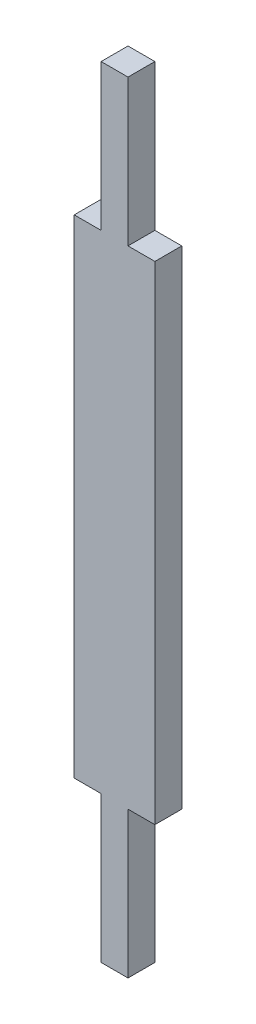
from build123d import *

# Parameters (mm, degrees)
BOSS_EXTRUDE1_DEPTH = 1.524


with BuildPart() as part:
    # Sketch1 → Boss-Extrude1 (new body)
    with BuildSketch(Plane.XY):
        Polygon((1.524, -22.084125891), (0, -22.084125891), (0, 5.561001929), (1.524, 5.561001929), (1.524, 13.84836263), (3.048, 13.84836263), (3.048, 5.561001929), (4.572, 5.561001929), (4.572, -22.084125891), (3.048, -22.084125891), (3.048, -30.371486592), (1.524, -30.371486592), align=None)
    extrude(amount=BOSS_EXTRUDE1_DEPTH)


solid = part.part
